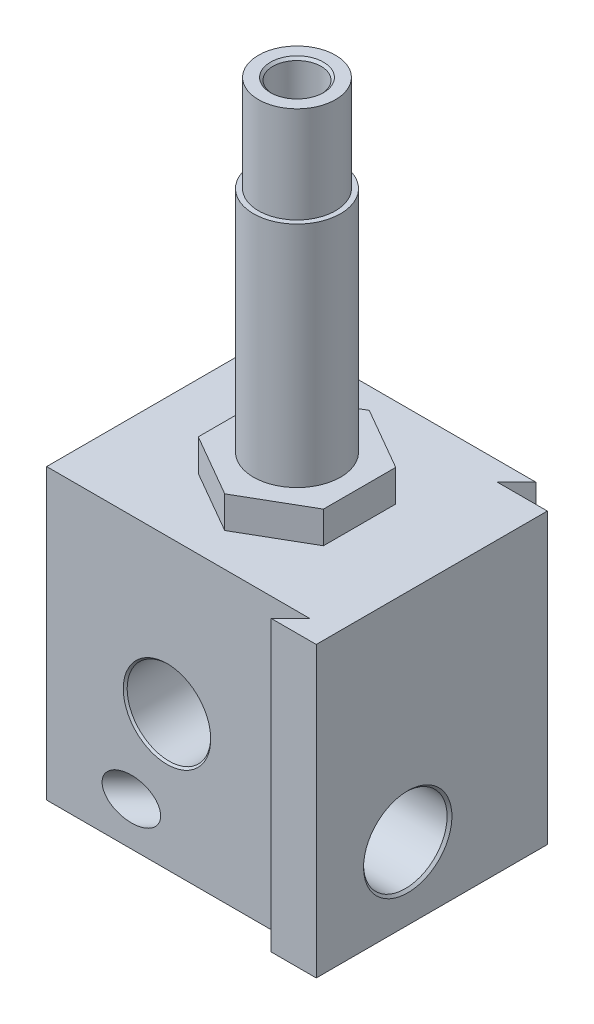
ISO-10303-21;
HEADER;
FILE_DESCRIPTION(('STEP AP214'),'2;1');
FILE_NAME('part.step','',(''),(''),'','','');
FILE_SCHEMA(('AUTOMOTIVE_DESIGN { 1 0 10303 214 1 1 1 1 }'));
ENDSEC;
DATA;
#1=APPLICATION_CONTEXT('core data for automotive mechanical design processes');
#2=APPLICATION_PROTOCOL_DEFINITION('international standard','automotive_design',2000,#1);
#3=PRODUCT_CONTEXT('',#1,'mechanical');
#4=PRODUCT('Part','Part','',(#3));
#5=PRODUCT_RELATED_PRODUCT_CATEGORY('part','',(#4));
#6=PRODUCT_DEFINITION_FORMATION('','',#4);
#7=PRODUCT_DEFINITION_CONTEXT('part definition',#1,'design');
#8=PRODUCT_DEFINITION('design','',#6,#7);
#9=PRODUCT_DEFINITION_SHAPE('','',#8);
#10=(LENGTH_UNIT() NAMED_UNIT(*) SI_UNIT(.MILLI.,.METRE.));
#11=(NAMED_UNIT(*) PLANE_ANGLE_UNIT() SI_UNIT($,.RADIAN.));
#12=(NAMED_UNIT(*) SI_UNIT($,.STERADIAN.) SOLID_ANGLE_UNIT());
#13=UNCERTAINTY_MEASURE_WITH_UNIT(LENGTH_MEASURE(1.E-05),#10,'distance_accuracy_value','');
#14=(GEOMETRIC_REPRESENTATION_CONTEXT(3) GLOBAL_UNCERTAINTY_ASSIGNED_CONTEXT((#13)) GLOBAL_UNIT_ASSIGNED_CONTEXT((#10,
#11,#12)) REPRESENTATION_CONTEXT('',''));
#15=CARTESIAN_POINT('',(0.,0.,0.));
#16=DIRECTION('',(0.,0.,1.));
#17=DIRECTION('',(1.,0.,0.));
#18=AXIS2_PLACEMENT_3D('',#15,#16,#17);
#19=CARTESIAN_POINT('',(0.,30.,-26.));
#20=DIRECTION('',(0.,-1.,0.));
#21=DIRECTION('',(-1.,0.,0.));
#22=AXIS2_PLACEMENT_3D('',#19,#20,#21);
#23=PLANE('',#22);
#24=DIRECTION('',(0.,0.,1.));
#25=VECTOR('',#24,1.);
#26=CARTESIAN_POINT('',(0.,30.,0.));
#27=LINE('',#26,#25);
#28=CARTESIAN_POINT('',(0.,30.,-26.));
#29=VERTEX_POINT('',#28);
#30=CARTESIAN_POINT('',(0.,30.,-1.99999999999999));
#31=VERTEX_POINT('',#30);
#32=EDGE_CURVE('E291',#29,#31,#27,.T.);
#33=ORIENTED_EDGE('',*,*,#32,.T.);
#34=DIRECTION('',(-1.,0.,0.));
#35=VECTOR('',#34,1.);
#36=CARTESIAN_POINT('',(0.,30.,-1.99999999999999));
#37=LINE('',#36,#35);
#38=CARTESIAN_POINT('',(27.3,30.,-1.99999999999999));
#39=VERTEX_POINT('',#38);
#40=EDGE_CURVE('E248',#39,#31,#37,.T.);
#41=ORIENTED_EDGE('',*,*,#40,.F.);
#42=DIRECTION('',(0.707106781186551,0.,-0.707106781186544));
#43=VECTOR('',#42,1.);
#44=CARTESIAN_POINT('',(27.3,30.,-1.99999999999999));
#45=LINE('',#44,#43);
#46=CARTESIAN_POINT('',(25.3,30.,0.));
#47=VERTEX_POINT('',#46);
#48=EDGE_CURVE('E245',#47,#39,#45,.T.);
#49=ORIENTED_EDGE('',*,*,#48,.F.);
#50=DIRECTION('',(1.,0.,0.));
#51=VECTOR('',#50,1.);
#52=CARTESIAN_POINT('',(0.,30.,0.));
#53=LINE('',#52,#51);
#54=CARTESIAN_POINT('',(30.,30.,0.));
#55=VERTEX_POINT('',#54);
#56=EDGE_CURVE('E294',#47,#55,#53,.T.);
#57=ORIENTED_EDGE('',*,*,#56,.T.);
#58=DIRECTION('',(0.,0.,-1.));
#59=VECTOR('',#58,1.);
#60=CARTESIAN_POINT('',(30.,30.,0.));
#61=LINE('',#60,#59);
#62=CARTESIAN_POINT('',(30.,30.,-24.));
#63=VERTEX_POINT('',#62);
#64=EDGE_CURVE('E296',#55,#63,#61,.T.);
#65=ORIENTED_EDGE('',*,*,#64,.T.);
#66=DIRECTION('',(1.,0.,0.));
#67=VECTOR('',#66,1.);
#68=CARTESIAN_POINT('',(24.8,30.,-24.));
#69=LINE('',#68,#67);
#70=CARTESIAN_POINT('',(24.8,30.,-24.));
#71=VERTEX_POINT('',#70);
#72=EDGE_CURVE('E266',#71,#63,#69,.T.);
#73=ORIENTED_EDGE('',*,*,#72,.F.);
#74=DIRECTION('',(-0.707106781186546,0.,0.707106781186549));
#75=VECTOR('',#74,1.);
#76=CARTESIAN_POINT('',(26.8,30.,-26.));
#77=LINE('',#76,#75);
#78=CARTESIAN_POINT('',(26.8,30.,-26.));
#79=VERTEX_POINT('',#78);
#80=EDGE_CURVE('E260',#79,#71,#77,.T.);
#81=ORIENTED_EDGE('',*,*,#80,.F.);
#82=DIRECTION('',(-1.,0.,0.));
#83=VECTOR('',#82,1.);
#84=CARTESIAN_POINT('',(0.,30.,-26.));
#85=LINE('',#84,#83);
#86=EDGE_CURVE('E299',#79,#29,#85,.T.);
#87=ORIENTED_EDGE('',*,*,#86,.T.);
#88=EDGE_LOOP('',(#33,#41,#49,#57,#65,#73,#81,#87));
#89=FACE_BOUND('',#88,.T.);
#90=DIRECTION('',(0.,0.,-1.));
#91=VECTOR('',#90,1.);
#92=CARTESIAN_POINT('',(8.5,30.,-9.24722325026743));
#93=LINE('',#92,#91);
#94=CARTESIAN_POINT('',(8.5,30.,-9.24722325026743));
#95=VERTEX_POINT('',#94);
#96=CARTESIAN_POINT('',(8.5,30.,-16.7527767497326));
#97=VERTEX_POINT('',#96);
#98=EDGE_CURVE('E30',#95,#97,#93,.T.);
#99=ORIENTED_EDGE('',*,*,#98,.T.);
#100=DIRECTION('',(0.866025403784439,0.,-0.5));
#101=VECTOR('',#100,1.);
#102=CARTESIAN_POINT('',(8.5,30.,-16.7527767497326));
#103=LINE('',#102,#101);
#104=CARTESIAN_POINT('',(15.,30.,-20.5055534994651));
#105=VERTEX_POINT('',#104);
#106=EDGE_CURVE('E35',#97,#105,#103,.T.);
#107=ORIENTED_EDGE('',*,*,#106,.T.);
#108=DIRECTION('',(0.866025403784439,0.,0.5));
#109=VECTOR('',#108,1.);
#110=CARTESIAN_POINT('',(15.,30.,-20.5055534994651));
#111=LINE('',#110,#109);
#112=CARTESIAN_POINT('',(21.5,30.,-16.7527767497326));
#113=VERTEX_POINT('',#112);
#114=EDGE_CURVE('E153',#105,#113,#111,.T.);
#115=ORIENTED_EDGE('',*,*,#114,.T.);
#116=DIRECTION('',(0.,0.,1.));
#117=VECTOR('',#116,1.);
#118=CARTESIAN_POINT('',(21.5,30.,-16.7527767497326));
#119=LINE('',#118,#117);
#120=CARTESIAN_POINT('',(21.5,30.,-9.24722325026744));
#121=VERTEX_POINT('',#120);
#122=EDGE_CURVE('E131',#113,#121,#119,.T.);
#123=ORIENTED_EDGE('',*,*,#122,.T.);
#124=DIRECTION('',(-0.866025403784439,0.,0.5));
#125=VECTOR('',#124,1.);
#126=CARTESIAN_POINT('',(21.5,30.,-9.24722325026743));
#127=LINE('',#126,#125);
#128=CARTESIAN_POINT('',(15.,30.,-5.49444650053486));
#129=VERTEX_POINT('',#128);
#130=EDGE_CURVE('E125',#121,#129,#127,.T.);
#131=ORIENTED_EDGE('',*,*,#130,.T.);
#132=DIRECTION('',(-0.866025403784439,0.,-0.5));
#133=VECTOR('',#132,1.);
#134=CARTESIAN_POINT('',(15.,30.,-5.49444650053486));
#135=LINE('',#134,#133);
#136=EDGE_CURVE('E128',#129,#95,#135,.T.);
#137=ORIENTED_EDGE('',*,*,#136,.T.);
#138=EDGE_LOOP('',(#99,#107,#115,#123,#131,#137));
#139=FACE_BOUND('',#138,.T.);
#140=ADVANCED_FACE('F15',(#89,#139),#23,.F.);
#141=CARTESIAN_POINT('',(12.5,14.,-26.));
#142=DIRECTION('',(0.,0.,1.));
#143=DIRECTION('',(1.,0.,0.));
#144=AXIS2_PLACEMENT_3D('',#141,#142,#143);
#145=CYLINDRICAL_SURFACE('',#144,3.);
#146=CARTESIAN_POINT('',(12.5,14.,-9.));
#147=DIRECTION('',(0.,0.,1.));
#148=DIRECTION('',(1.,0.,0.));
#149=AXIS2_PLACEMENT_3D('',#146,#147,#148);
#150=CIRCLE('',#149,3.);
#151=CARTESIAN_POINT('',(15.5,14.,-9.));
#152=VERTEX_POINT('',#151);
#153=EDGE_CURVE('E212',#152,#152,#150,.F.);
#154=ORIENTED_EDGE('',*,*,#153,.F.);
#155=EDGE_LOOP('',(#154));
#156=FACE_BOUND('',#155,.T.);
#157=CARTESIAN_POINT('',(12.5,14.,-17.6));
#158=DIRECTION('',(0.,0.,-1.));
#159=DIRECTION('',(0.,1.,0.));
#160=AXIS2_PLACEMENT_3D('',#157,#158,#159);
#161=CIRCLE('',#160,3.);
#162=CARTESIAN_POINT('',(12.5,17.,-17.6));
#163=VERTEX_POINT('',#162);
#164=EDGE_CURVE('E208',#163,#163,#161,.F.);
#165=ORIENTED_EDGE('',*,*,#164,.F.);
#166=EDGE_LOOP('',(#165));
#167=FACE_BOUND('',#166,.T.);
#168=ADVANCED_FACE('F370',(#156,#167),#145,.F.);
#169=CARTESIAN_POINT('',(0.,30.,0.));
#170=DIRECTION('',(1.,0.,0.));
#171=DIRECTION('',(0.,-1.,0.));
#172=AXIS2_PLACEMENT_3D('',#169,#170,#171);
#173=PLANE('',#172);
#174=CARTESIAN_POINT('',(0.,4.5,-17.2));
#175=DIRECTION('',(1.,0.,0.));
#176=DIRECTION('',(0.,0.,1.));
#177=AXIS2_PLACEMENT_3D('',#174,#175,#176);
#178=ELLIPSE('',#177,5.65685424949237,4.);
#179=CARTESIAN_POINT('',(0.,4.5,-11.5431457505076));
#180=VERTEX_POINT('',#179);
#181=EDGE_CURVE('E225',#180,#180,#178,.T.);
#182=ORIENTED_EDGE('',*,*,#181,.T.);
#183=EDGE_LOOP('',(#182));
#184=FACE_BOUND('',#183,.T.);
#185=DIRECTION('',(0.,0.,1.));
#186=VECTOR('',#185,1.);
#187=CARTESIAN_POINT('',(0.,0.,0.));
#188=LINE('',#187,#186);
#189=CARTESIAN_POINT('',(0.,0.,-26.));
#190=VERTEX_POINT('',#189);
#191=CARTESIAN_POINT('',(0.,0.,-2.));
#192=VERTEX_POINT('',#191);
#193=EDGE_CURVE('E278',#190,#192,#188,.T.);
#194=ORIENTED_EDGE('',*,*,#193,.T.);
#195=DIRECTION('',(0.,1.,0.));
#196=VECTOR('',#195,1.);
#197=CARTESIAN_POINT('',(0.,0.,-2.));
#198=LINE('',#197,#196);
#199=EDGE_CURVE('E257',#192,#31,#198,.T.);
#200=ORIENTED_EDGE('',*,*,#199,.T.);
#201=ORIENTED_EDGE('',*,*,#32,.F.);
#202=DIRECTION('',(0.,-1.,0.));
#203=VECTOR('',#202,1.);
#204=CARTESIAN_POINT('',(0.,30.,-26.));
#205=LINE('',#204,#203);
#206=EDGE_CURVE('E301',#29,#190,#205,.T.);
#207=ORIENTED_EDGE('',*,*,#206,.T.);
#208=EDGE_LOOP('',(#194,#200,#201,#207));
#209=FACE_BOUND('',#208,.T.);
#210=ADVANCED_FACE('F17',(#184,#209),#173,.F.);
#211=CARTESIAN_POINT('',(0.,30.,0.));
#212=DIRECTION('',(0.,0.,-1.));
#213=DIRECTION('',(0.,1.,0.));
#214=AXIS2_PLACEMENT_3D('',#211,#212,#213);
#215=PLANE('',#214);
#216=ORIENTED_EDGE('',*,*,#56,.F.);
#217=DIRECTION('',(0.,1.,0.));
#218=VECTOR('',#217,1.);
#219=CARTESIAN_POINT('',(25.3,0.,0.));
#220=LINE('',#219,#218);
#221=CARTESIAN_POINT('',(25.3,0.,0.));
#222=VERTEX_POINT('',#221);
#223=EDGE_CURVE('E256',#222,#47,#220,.T.);
#224=ORIENTED_EDGE('',*,*,#223,.F.);
#225=DIRECTION('',(1.,0.,0.));
#226=VECTOR('',#225,1.);
#227=CARTESIAN_POINT('',(0.,0.,0.));
#228=LINE('',#227,#226);
#229=CARTESIAN_POINT('',(30.,0.,0.));
#230=VERTEX_POINT('',#229);
#231=EDGE_CURVE('E284',#222,#230,#228,.T.);
#232=ORIENTED_EDGE('',*,*,#231,.T.);
#233=DIRECTION('',(0.,-1.,0.));
#234=VECTOR('',#233,1.);
#235=CARTESIAN_POINT('',(30.,30.,0.));
#236=LINE('',#235,#234);
#237=EDGE_CURVE('E304',#55,#230,#236,.T.);
#238=ORIENTED_EDGE('',*,*,#237,.F.);
#239=EDGE_LOOP('',(#216,#224,#232,#238));
#240=FACE_BOUND('',#239,.T.);
#241=ADVANCED_FACE('F389',(#240),#215,.F.);
#242=CARTESIAN_POINT('',(30.,30.,0.));
#243=DIRECTION('',(-1.,0.,0.));
#244=DIRECTION('',(0.,1.,0.));
#245=AXIS2_PLACEMENT_3D('',#242,#243,#244);
#246=PLANE('',#245);
#247=CARTESIAN_POINT('',(30.,7.5,-9.5));
#248=DIRECTION('',(-1.,0.,0.));
#249=DIRECTION('',(0.,1.,0.));
#250=AXIS2_PLACEMENT_3D('',#247,#248,#249);
#251=CIRCLE('',#250,4.59);
#252=CARTESIAN_POINT('',(30.,12.09,-9.5));
#253=VERTEX_POINT('',#252);
#254=EDGE_CURVE('E314',#253,#253,#251,.T.);
#255=ORIENTED_EDGE('',*,*,#254,.T.);
#256=EDGE_LOOP('',(#255));
#257=FACE_BOUND('',#256,.T.);
#258=DIRECTION('',(0.,0.,-1.));
#259=VECTOR('',#258,1.);
#260=CARTESIAN_POINT('',(30.,0.,0.));
#261=LINE('',#260,#259);
#262=CARTESIAN_POINT('',(30.,0.,-24.));
#263=VERTEX_POINT('',#262);
#264=EDGE_CURVE('E286',#230,#263,#261,.T.);
#265=ORIENTED_EDGE('',*,*,#264,.T.);
#266=DIRECTION('',(0.,1.,0.));
#267=VECTOR('',#266,1.);
#268=CARTESIAN_POINT('',(30.,0.,-24.));
#269=LINE('',#268,#267);
#270=EDGE_CURVE('E275',#263,#63,#269,.T.);
#271=ORIENTED_EDGE('',*,*,#270,.T.);
#272=ORIENTED_EDGE('',*,*,#64,.F.);
#273=ORIENTED_EDGE('',*,*,#237,.T.);
#274=EDGE_LOOP('',(#265,#271,#272,#273));
#275=FACE_BOUND('',#274,.T.);
#276=ADVANCED_FACE('F386',(#257,#275),#246,.F.);
#277=CARTESIAN_POINT('',(0.,30.,-26.));
#278=DIRECTION('',(0.,0.,1.));
#279=DIRECTION('',(0.,-1.,0.));
#280=AXIS2_PLACEMENT_3D('',#277,#278,#279);
#281=PLANE('',#280);
#282=CARTESIAN_POINT('',(8.80000000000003,4.5,-26.));
#283=DIRECTION('',(0.,0.,1.));
#284=DIRECTION('',(-1.,0.,0.));
#285=AXIS2_PLACEMENT_3D('',#282,#283,#284);
#286=ELLIPSE('',#285,3.04055915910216,2.15);
#287=CARTESIAN_POINT('',(5.75944084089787,4.5,-26.));
#288=VERTEX_POINT('',#287);
#289=EDGE_CURVE('E219',#288,#288,#286,.T.);
#290=ORIENTED_EDGE('',*,*,#289,.T.);
#291=EDGE_LOOP('',(#290));
#292=FACE_BOUND('',#291,.T.);
#293=CARTESIAN_POINT('',(12.5,14.,-26.));
#294=DIRECTION('',(0.,0.,-1.));
#295=DIRECTION('',(0.,1.,0.));
#296=AXIS2_PLACEMENT_3D('',#293,#294,#295);
#297=CIRCLE('',#296,7.);
#298=CARTESIAN_POINT('',(12.5,21.,-26.));
#299=VERTEX_POINT('',#298);
#300=EDGE_CURVE('E239',#299,#299,#297,.T.);
#301=ORIENTED_EDGE('',*,*,#300,.F.);
#302=EDGE_LOOP('',(#301));
#303=FACE_BOUND('',#302,.T.);
#304=ORIENTED_EDGE('',*,*,#86,.F.);
#305=DIRECTION('',(0.,1.,0.));
#306=VECTOR('',#305,1.);
#307=CARTESIAN_POINT('',(26.8,0.,-26.));
#308=LINE('',#307,#306);
#309=CARTESIAN_POINT('',(26.8,0.,-26.));
#310=VERTEX_POINT('',#309);
#311=EDGE_CURVE('E274',#310,#79,#308,.T.);
#312=ORIENTED_EDGE('',*,*,#311,.F.);
#313=DIRECTION('',(-1.,0.,0.));
#314=VECTOR('',#313,1.);
#315=CARTESIAN_POINT('',(0.,0.,-26.));
#316=LINE('',#315,#314);
#317=EDGE_CURVE('E289',#310,#190,#316,.T.);
#318=ORIENTED_EDGE('',*,*,#317,.T.);
#319=ORIENTED_EDGE('',*,*,#206,.F.);
#320=EDGE_LOOP('',(#304,#312,#318,#319));
#321=FACE_BOUND('',#320,.T.);
#322=ADVANCED_FACE('F383',(#292,#303,#321),#281,.F.);
#323=CARTESIAN_POINT('',(0.,0.,-26.));
#324=DIRECTION('',(0.,-1.,0.));
#325=DIRECTION('',(-1.,0.,0.));
#326=AXIS2_PLACEMENT_3D('',#323,#324,#325);
#327=PLANE('',#326);
#328=CARTESIAN_POINT('',(3.,0.,-5.));
#329=DIRECTION('',(0.,-1.,0.));
#330=DIRECTION('',(-1.,0.,0.));
#331=AXIS2_PLACEMENT_3D('',#328,#329,#330);
#332=CIRCLE('',#331,1.84999999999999);
#333=CARTESIAN_POINT('',(1.15000000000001,0.,-5.));
#334=VERTEX_POINT('',#333);
#335=EDGE_CURVE('E329',#334,#334,#332,.F.);
#336=ORIENTED_EDGE('',*,*,#335,.T.);
#337=EDGE_LOOP('',(#336));
#338=FACE_BOUND('',#337,.T.);
#339=CARTESIAN_POINT('',(22.5,0.,-21.5));
#340=DIRECTION('',(0.,-1.,0.));
#341=DIRECTION('',(-1.,0.,0.));
#342=AXIS2_PLACEMENT_3D('',#339,#340,#341);
#343=CIRCLE('',#342,1.84999999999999);
#344=CARTESIAN_POINT('',(20.65,0.,-21.5));
#345=VERTEX_POINT('',#344);
#346=EDGE_CURVE('E326',#345,#345,#343,.F.);
#347=ORIENTED_EDGE('',*,*,#346,.T.);
#348=EDGE_LOOP('',(#347));
#349=FACE_BOUND('',#348,.T.);
#350=DIRECTION('',(-1.,0.,0.));
#351=VECTOR('',#350,1.);
#352=CARTESIAN_POINT('',(0.,0.,-2.));
#353=LINE('',#352,#351);
#354=CARTESIAN_POINT('',(27.3,0.,-2.));
#355=VERTEX_POINT('',#354);
#356=EDGE_CURVE('E253',#355,#192,#353,.T.);
#357=ORIENTED_EDGE('',*,*,#356,.T.);
#358=ORIENTED_EDGE('',*,*,#193,.F.);
#359=ORIENTED_EDGE('',*,*,#317,.F.);
#360=DIRECTION('',(-0.707106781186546,0.,0.707106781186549));
#361=VECTOR('',#360,1.);
#362=CARTESIAN_POINT('',(26.8,0.,-26.));
#363=LINE('',#362,#361);
#364=CARTESIAN_POINT('',(24.8,0.,-24.));
#365=VERTEX_POINT('',#364);
#366=EDGE_CURVE('E268',#310,#365,#363,.T.);
#367=ORIENTED_EDGE('',*,*,#366,.T.);
#368=DIRECTION('',(1.,0.,0.));
#369=VECTOR('',#368,1.);
#370=CARTESIAN_POINT('',(24.8,0.,-24.));
#371=LINE('',#370,#369);
#372=EDGE_CURVE('E271',#365,#263,#371,.T.);
#373=ORIENTED_EDGE('',*,*,#372,.T.);
#374=ORIENTED_EDGE('',*,*,#264,.F.);
#375=ORIENTED_EDGE('',*,*,#231,.F.);
#376=DIRECTION('',(0.707106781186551,0.,-0.707106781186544));
#377=VECTOR('',#376,1.);
#378=CARTESIAN_POINT('',(27.3,0.,-2.));
#379=LINE('',#378,#377);
#380=EDGE_CURVE('E250',#222,#355,#379,.T.);
#381=ORIENTED_EDGE('',*,*,#380,.T.);
#382=EDGE_LOOP('',(#357,#358,#359,#367,#373,#374,#375,#381));
#383=FACE_BOUND('',#382,.T.);
#384=ADVANCED_FACE('F381',(#338,#349,#383),#327,.T.);
#385=CARTESIAN_POINT('',(24.8,0.,-24.));
#386=DIRECTION('',(0.,0.,1.));
#387=DIRECTION('',(0.,-1.,0.));
#388=AXIS2_PLACEMENT_3D('',#385,#386,#387);
#389=PLANE('',#388);
#390=ORIENTED_EDGE('',*,*,#72,.T.);
#391=ORIENTED_EDGE('',*,*,#270,.F.);
#392=ORIENTED_EDGE('',*,*,#372,.F.);
#393=DIRECTION('',(0.,1.,0.));
#394=VECTOR('',#393,1.);
#395=CARTESIAN_POINT('',(24.8,0.,-24.));
#396=LINE('',#395,#394);
#397=EDGE_CURVE('E279',#365,#71,#396,.T.);
#398=ORIENTED_EDGE('',*,*,#397,.T.);
#399=EDGE_LOOP('',(#390,#391,#392,#398));
#400=FACE_BOUND('',#399,.T.);
#401=ADVANCED_FACE('F414',(#400),#389,.F.);
#402=CARTESIAN_POINT('',(26.8,0.,-26.));
#403=DIRECTION('',(-0.707106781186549,0.,-0.707106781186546));
#404=DIRECTION('',(-0.707106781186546,0.,0.707106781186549));
#405=AXIS2_PLACEMENT_3D('',#402,#403,#404);
#406=PLANE('',#405);
#407=ORIENTED_EDGE('',*,*,#80,.T.);
#408=ORIENTED_EDGE('',*,*,#397,.F.);
#409=ORIENTED_EDGE('',*,*,#366,.F.);
#410=ORIENTED_EDGE('',*,*,#311,.T.);
#411=EDGE_LOOP('',(#407,#408,#409,#410));
#412=FACE_BOUND('',#411,.T.);
#413=ADVANCED_FACE('F419',(#412),#406,.F.);
#414=CARTESIAN_POINT('',(0.,0.,-2.));
#415=DIRECTION('',(0.,0.,-1.));
#416=DIRECTION('',(-1.,0.,0.));
#417=AXIS2_PLACEMENT_3D('',#414,#415,#416);
#418=PLANE('',#417);
#419=CARTESIAN_POINT('',(12.5,14.,-2.));
#420=DIRECTION('',(0.,0.,-1.));
#421=DIRECTION('',(-1.,0.,0.));
#422=AXIS2_PLACEMENT_3D('',#419,#420,#421);
#423=CIRCLE('',#422,4.54000000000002);
#424=CARTESIAN_POINT('',(7.95999999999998,14.,-2.));
#425=VERTEX_POINT('',#424);
#426=EDGE_CURVE('E10',#425,#425,#423,.T.);
#427=ORIENTED_EDGE('',*,*,#426,.T.);
#428=EDGE_LOOP('',(#427));
#429=FACE_BOUND('',#428,.T.);
#430=CARTESIAN_POINT('',(8.8,4.5,-2.));
#431=DIRECTION('',(0.,0.,-1.));
#432=DIRECTION('',(-1.,0.,0.));
#433=AXIS2_PLACEMENT_3D('',#430,#431,#432);
#434=ELLIPSE('',#433,3.04055915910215,2.15);
#435=CARTESIAN_POINT('',(5.75944084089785,4.5,-2.));
#436=VERTEX_POINT('',#435);
#437=EDGE_CURVE('E232',#436,#436,#434,.T.);
#438=ORIENTED_EDGE('',*,*,#437,.T.);
#439=EDGE_LOOP('',(#438));
#440=FACE_BOUND('',#439,.T.);
#441=ORIENTED_EDGE('',*,*,#40,.T.);
#442=ORIENTED_EDGE('',*,*,#199,.F.);
#443=ORIENTED_EDGE('',*,*,#356,.F.);
#444=DIRECTION('',(0.,1.,0.));
#445=VECTOR('',#444,1.);
#446=CARTESIAN_POINT('',(27.3,0.,-2.));
#447=LINE('',#446,#445);
#448=EDGE_CURVE('E261',#355,#39,#447,.T.);
#449=ORIENTED_EDGE('',*,*,#448,.T.);
#450=EDGE_LOOP('',(#441,#442,#443,#449));
#451=FACE_BOUND('',#450,.T.);
#452=ADVANCED_FACE('F427',(#429,#440,#451),#418,.F.);
#453=CARTESIAN_POINT('',(27.3,0.,-2.));
#454=DIRECTION('',(0.707106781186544,0.,0.707106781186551));
#455=DIRECTION('',(0.707106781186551,0.,-0.707106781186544));
#456=AXIS2_PLACEMENT_3D('',#453,#454,#455);
#457=PLANE('',#456);
#458=ORIENTED_EDGE('',*,*,#48,.T.);
#459=ORIENTED_EDGE('',*,*,#448,.F.);
#460=ORIENTED_EDGE('',*,*,#380,.F.);
#461=ORIENTED_EDGE('',*,*,#223,.T.);
#462=EDGE_LOOP('',(#458,#459,#460,#461));
#463=FACE_BOUND('',#462,.T.);
#464=ADVANCED_FACE('F408',(#463),#457,.F.);
#465=CARTESIAN_POINT('',(12.5,14.,-24.6));
#466=DIRECTION('',(0.,0.,-1.));
#467=DIRECTION('',(0.,1.,0.));
#468=AXIS2_PLACEMENT_3D('',#465,#466,#467);
#469=PLANE('',#468);
#470=CARTESIAN_POINT('',(12.5,14.,-24.6));
#471=DIRECTION('',(0.,0.,-1.));
#472=DIRECTION('',(0.,1.,0.));
#473=AXIS2_PLACEMENT_3D('',#470,#471,#472);
#474=CIRCLE('',#473,4.54);
#475=CARTESIAN_POINT('',(12.5,18.54,-24.6));
#476=VERTEX_POINT('',#475);
#477=EDGE_CURVE('E342',#476,#476,#474,.F.);
#478=ORIENTED_EDGE('',*,*,#477,.T.);
#479=EDGE_LOOP('',(#478));
#480=FACE_BOUND('',#479,.T.);
#481=CARTESIAN_POINT('',(12.5,14.,-24.6));
#482=DIRECTION('',(0.,0.,-1.));
#483=DIRECTION('',(0.,1.,0.));
#484=AXIS2_PLACEMENT_3D('',#481,#482,#483);
#485=CIRCLE('',#484,7.);
#486=CARTESIAN_POINT('',(12.5,21.,-24.6));
#487=VERTEX_POINT('',#486);
#488=EDGE_CURVE('E242',#487,#487,#485,.T.);
#489=ORIENTED_EDGE('',*,*,#488,.T.);
#490=EDGE_LOOP('',(#489));
#491=FACE_BOUND('',#490,.T.);
#492=ADVANCED_FACE('F436',(#480,#491),#469,.T.);
#493=CARTESIAN_POINT('',(12.5,14.,-24.6));
#494=DIRECTION('',(0.,0.,-1.));
#495=DIRECTION('',(0.,1.,0.));
#496=AXIS2_PLACEMENT_3D('',#493,#494,#495);
#497=CYLINDRICAL_SURFACE('',#496,7.);
#498=ORIENTED_EDGE('',*,*,#488,.F.);
#499=EDGE_LOOP('',(#498));
#500=FACE_BOUND('',#499,.T.);
#501=ORIENTED_EDGE('',*,*,#300,.T.);
#502=EDGE_LOOP('',(#501));
#503=FACE_BOUND('',#502,.T.);
#504=ADVANCED_FACE('F489',(#500,#503),#497,.F.);
#505=CARTESIAN_POINT('',(3.,0.,-5.));
#506=DIRECTION('',(0.,-1.,0.));
#507=DIRECTION('',(-1.,0.,0.));
#508=AXIS2_PLACEMENT_3D('',#505,#506,#507);
#509=CYLINDRICAL_SURFACE('',#508,1.64999999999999);
#510=CARTESIAN_POINT('',(3.,0.199999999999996,-5.));
#511=DIRECTION('',(0.,-1.,0.));
#512=DIRECTION('',(-1.,0.,0.));
#513=AXIS2_PLACEMENT_3D('',#510,#511,#512);
#514=CIRCLE('',#513,1.64999999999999);
#515=CARTESIAN_POINT('',(1.35000000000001,0.199999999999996,-5.));
#516=VERTEX_POINT('',#515);
#517=EDGE_CURVE('E323',#516,#516,#514,.T.);
#518=ORIENTED_EDGE('',*,*,#517,.T.);
#519=EDGE_LOOP('',(#518));
#520=FACE_BOUND('',#519,.T.);
#521=CARTESIAN_POINT('',(3.,12.,-5.));
#522=DIRECTION('',(0.,-1.,0.));
#523=DIRECTION('',(-1.,0.,0.));
#524=AXIS2_PLACEMENT_3D('',#521,#522,#523);
#525=CIRCLE('',#524,1.65);
#526=CARTESIAN_POINT('',(1.35,12.,-5.));
#527=VERTEX_POINT('',#526);
#528=EDGE_CURVE('E236',#527,#527,#525,.T.);
#529=ORIENTED_EDGE('',*,*,#528,.F.);
#530=EDGE_LOOP('',(#529));
#531=FACE_BOUND('',#530,.T.);
#532=ADVANCED_FACE('F485',(#520,#531),#509,.F.);
#533=CARTESIAN_POINT('',(3.,12.,-5.));
#534=DIRECTION('',(0.,-1.,0.));
#535=DIRECTION('',(-1.,0.,0.));
#536=AXIS2_PLACEMENT_3D('',#533,#534,#535);
#537=CONICAL_SURFACE('',#536,1.65,1.0471975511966);
#538=CARTESIAN_POINT('',(3.,12.9526279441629,-5.));
#539=VERTEX_POINT('',#538);
#540=VERTEX_LOOP('',#539);
#541=FACE_BOUND('',#540,.T.);
#542=ORIENTED_EDGE('',*,*,#528,.T.);
#543=EDGE_LOOP('',(#542));
#544=FACE_BOUND('',#543,.T.);
#545=ADVANCED_FACE('F466',(#541,#544),#537,.F.);
#546=CARTESIAN_POINT('',(22.5,0.,-21.5));
#547=DIRECTION('',(0.,-1.,0.));
#548=DIRECTION('',(-1.,0.,0.));
#549=AXIS2_PLACEMENT_3D('',#546,#547,#548);
#550=CYLINDRICAL_SURFACE('',#549,1.65);
#551=CARTESIAN_POINT('',(22.5,0.199999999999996,-21.5));
#552=DIRECTION('',(0.,-1.,0.));
#553=DIRECTION('',(-1.,0.,0.));
#554=AXIS2_PLACEMENT_3D('',#551,#552,#553);
#555=CIRCLE('',#554,1.65);
#556=CARTESIAN_POINT('',(20.85,0.199999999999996,-21.5));
#557=VERTEX_POINT('',#556);
#558=EDGE_CURVE('E332',#557,#557,#555,.T.);
#559=ORIENTED_EDGE('',*,*,#558,.T.);
#560=EDGE_LOOP('',(#559));
#561=FACE_BOUND('',#560,.T.);
#562=CARTESIAN_POINT('',(22.5,12.,-21.5));
#563=DIRECTION('',(0.,-1.,0.));
#564=DIRECTION('',(-1.,0.,0.));
#565=AXIS2_PLACEMENT_3D('',#562,#563,#564);
#566=CIRCLE('',#565,1.65);
#567=CARTESIAN_POINT('',(20.85,12.,-21.5));
#568=VERTEX_POINT('',#567);
#569=EDGE_CURVE('E233',#568,#568,#566,.T.);
#570=ORIENTED_EDGE('',*,*,#569,.F.);
#571=EDGE_LOOP('',(#570));
#572=FACE_BOUND('',#571,.T.);
#573=ADVANCED_FACE('F462',(#561,#572),#550,.F.);
#574=CARTESIAN_POINT('',(22.5,12.,-21.5));
#575=DIRECTION('',(0.,-1.,0.));
#576=DIRECTION('',(-1.,0.,0.));
#577=AXIS2_PLACEMENT_3D('',#574,#575,#576);
#578=CONICAL_SURFACE('',#577,1.65,1.0471975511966);
#579=CARTESIAN_POINT('',(22.5,12.9526279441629,-21.5));
#580=VERTEX_POINT('',#579);
#581=VERTEX_LOOP('',#580);
#582=FACE_BOUND('',#581,.T.);
#583=ORIENTED_EDGE('',*,*,#569,.T.);
#584=EDGE_LOOP('',(#583));
#585=FACE_BOUND('',#584,.T.);
#586=ADVANCED_FACE('F465',(#582,#585),#578,.F.);
#587=CARTESIAN_POINT('',(10.5664263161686,4.5,-3.76642631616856));
#588=DIRECTION('',(-0.707106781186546,0.,0.707106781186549));
#589=DIRECTION('',(0.707106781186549,0.,0.707106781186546));
#590=AXIS2_PLACEMENT_3D('',#587,#588,#589);
#591=CYLINDRICAL_SURFACE('',#590,2.15);
#592=CARTESIAN_POINT('',(10.5664263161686,4.5,-3.76642631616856));
#593=DIRECTION('',(-0.707106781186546,0.,0.707106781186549));
#594=DIRECTION('',(0.707106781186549,0.,0.707106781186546));
#595=AXIS2_PLACEMENT_3D('',#592,#593,#594);
#596=CIRCLE('',#595,2.15);
#597=CARTESIAN_POINT('',(12.0867058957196,4.5,-2.24614673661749));
#598=VERTEX_POINT('',#597);
#599=EDGE_CURVE('E229',#598,#598,#596,.T.);
#600=ORIENTED_EDGE('',*,*,#599,.F.);
#601=EDGE_LOOP('',(#600));
#602=FACE_BOUND('',#601,.T.);
#603=ORIENTED_EDGE('',*,*,#437,.F.);
#604=EDGE_LOOP('',(#603));
#605=FACE_BOUND('',#604,.T.);
#606=ADVANCED_FACE('F471',(#602,#605),#591,.F.);
#607=CARTESIAN_POINT('',(10.5664263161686,4.5,-3.76642631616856));
#608=DIRECTION('',(-0.707106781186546,0.,0.707106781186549));
#609=DIRECTION('',(0.707106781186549,0.,0.707106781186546));
#610=AXIS2_PLACEMENT_3D('',#607,#608,#609);
#611=PLANE('',#610);
#612=CARTESIAN_POINT('',(10.5664263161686,4.5,-3.76642631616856));
#613=DIRECTION('',(-0.707106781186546,0.,0.707106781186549));
#614=DIRECTION('',(0.707106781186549,0.,0.707106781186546));
#615=AXIS2_PLACEMENT_3D('',#612,#613,#614);
#616=CIRCLE('',#615,1.84999999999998);
#617=CARTESIAN_POINT('',(11.8745738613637,4.5,-2.45827877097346));
#618=VERTEX_POINT('',#617);
#619=EDGE_CURVE('E320',#618,#618,#616,.F.);
#620=ORIENTED_EDGE('',*,*,#619,.T.);
#621=EDGE_LOOP('',(#620));
#622=FACE_BOUND('',#621,.T.);
#623=ORIENTED_EDGE('',*,*,#599,.T.);
#624=EDGE_LOOP('',(#623));
#625=FACE_BOUND('',#624,.T.);
#626=ADVANCED_FACE('F478',(#622,#625),#611,.T.);
#627=CARTESIAN_POINT('',(10.5664263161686,4.5,-3.76642631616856));
#628=DIRECTION('',(-0.707106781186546,0.,0.707106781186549));
#629=DIRECTION('',(0.707106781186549,0.,0.707106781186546));
#630=AXIS2_PLACEMENT_3D('',#627,#628,#629);
#631=CYLINDRICAL_SURFACE('',#630,1.64999999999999);
#632=CARTESIAN_POINT('',(10.7078476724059,4.5,-3.90784767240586));
#633=DIRECTION('',(-0.707106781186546,0.,0.707106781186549));
#634=DIRECTION('',(0.707106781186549,0.,0.707106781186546));
#635=AXIS2_PLACEMENT_3D('',#632,#633,#634);
#636=CIRCLE('',#635,1.64999999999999);
#637=CARTESIAN_POINT('',(11.8745738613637,4.5,-2.74112148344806));
#638=VERTEX_POINT('',#637);
#639=EDGE_CURVE('E317',#638,#638,#636,.T.);
#640=ORIENTED_EDGE('',*,*,#639,.T.);
#641=EDGE_LOOP('',(#640));
#642=FACE_BOUND('',#641,.T.);
#643=CARTESIAN_POINT('',(15.8697271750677,4.5,-9.06972717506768));
#644=DIRECTION('',(-0.707106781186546,0.,0.707106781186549));
#645=DIRECTION('',(0.707106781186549,0.,0.707106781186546));
#646=AXIS2_PLACEMENT_3D('',#643,#644,#645);
#647=CIRCLE('',#646,1.65);
#648=CARTESIAN_POINT('',(17.0364533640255,4.5,-7.90300098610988));
#649=VERTEX_POINT('',#648);
#650=EDGE_CURVE('E226',#649,#649,#647,.T.);
#651=ORIENTED_EDGE('',*,*,#650,.F.);
#652=EDGE_LOOP('',(#651));
#653=FACE_BOUND('',#652,.T.);
#654=ADVANCED_FACE('F536',(#642,#653),#631,.F.);
#655=CARTESIAN_POINT('',(15.8697271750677,4.5,-9.06972717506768));
#656=DIRECTION('',(-0.707106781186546,0.,0.707106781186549));
#657=DIRECTION('',(0.707106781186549,0.,0.707106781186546));
#658=AXIS2_PLACEMENT_3D('',#655,#656,#657);
#659=CONICAL_SURFACE('',#658,1.65,1.0471975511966);
#660=CARTESIAN_POINT('',(16.543336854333,4.5,-9.74333685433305));
#661=VERTEX_POINT('',#660);
#662=VERTEX_LOOP('',#661);
#663=FACE_BOUND('',#662,.T.);
#664=ORIENTED_EDGE('',*,*,#650,.T.);
#665=EDGE_LOOP('',(#664));
#666=FACE_BOUND('',#665,.T.);
#667=ADVANCED_FACE('F543',(#663,#666),#659,.F.);
#668=CARTESIAN_POINT('',(5.58614357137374,4.5,-22.7861435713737));
#669=DIRECTION('',(-0.707106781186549,0.,0.707106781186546));
#670=DIRECTION('',(0.707106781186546,0.,0.707106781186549));
#671=AXIS2_PLACEMENT_3D('',#668,#669,#670);
#672=CYLINDRICAL_SURFACE('',#671,4.);
#673=CARTESIAN_POINT('',(5.58614357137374,4.5,-22.7861435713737));
#674=DIRECTION('',(-0.707106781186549,0.,0.707106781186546));
#675=DIRECTION('',(0.707106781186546,0.,0.707106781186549));
#676=AXIS2_PLACEMENT_3D('',#673,#674,#675);
#677=CIRCLE('',#676,4.);
#678=CARTESIAN_POINT('',(8.41457069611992,4.5,-19.9577164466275));
#679=VERTEX_POINT('',#678);
#680=EDGE_CURVE('E222',#679,#679,#677,.T.);
#681=ORIENTED_EDGE('',*,*,#680,.F.);
#682=EDGE_LOOP('',(#681));
#683=FACE_BOUND('',#682,.T.);
#684=ORIENTED_EDGE('',*,*,#181,.F.);
#685=EDGE_LOOP('',(#684));
#686=FACE_BOUND('',#685,.T.);
#687=ADVANCED_FACE('F552',(#683,#686),#672,.F.);
#688=CARTESIAN_POINT('',(5.58614357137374,4.5,-22.7861435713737));
#689=DIRECTION('',(-0.707106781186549,0.,0.707106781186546));
#690=DIRECTION('',(0.707106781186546,0.,0.707106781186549));
#691=AXIS2_PLACEMENT_3D('',#688,#689,#690);
#692=PLANE('',#691);
#693=CARTESIAN_POINT('',(5.58614357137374,4.5,-22.7861435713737));
#694=DIRECTION('',(-0.707106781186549,0.,0.707106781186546));
#695=DIRECTION('',(0.707106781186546,0.,0.707106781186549));
#696=AXIS2_PLACEMENT_3D('',#693,#694,#695);
#697=CIRCLE('',#696,2.15);
#698=CARTESIAN_POINT('',(7.10642315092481,4.5,-21.2658639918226));
#699=VERTEX_POINT('',#698);
#700=EDGE_CURVE('E216',#699,#699,#697,.T.);
#701=ORIENTED_EDGE('',*,*,#700,.F.);
#702=EDGE_LOOP('',(#701));
#703=FACE_BOUND('',#702,.T.);
#704=ORIENTED_EDGE('',*,*,#680,.T.);
#705=EDGE_LOOP('',(#704));
#706=FACE_BOUND('',#705,.T.);
#707=ADVANCED_FACE('F560',(#703,#706),#692,.T.);
#708=CARTESIAN_POINT('',(19.4000000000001,4.5,-36.6));
#709=DIRECTION('',(-0.707106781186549,0.,0.707106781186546));
#710=DIRECTION('',(0.707106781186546,0.,0.707106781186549));
#711=AXIS2_PLACEMENT_3D('',#708,#709,#710);
#712=CYLINDRICAL_SURFACE('',#711,2.15);
#713=ORIENTED_EDGE('',*,*,#700,.T.);
#714=EDGE_LOOP('',(#713));
#715=FACE_BOUND('',#714,.T.);
#716=ORIENTED_EDGE('',*,*,#289,.F.);
#717=EDGE_LOOP('',(#716));
#718=FACE_BOUND('',#717,.T.);
#719=ADVANCED_FACE('F568',(#715,#718),#712,.F.);
#720=CARTESIAN_POINT('',(18.7,7.5,-9.5));
#721=DIRECTION('',(1.,0.,0.));
#722=DIRECTION('',(0.,-1.,0.));
#723=AXIS2_PLACEMENT_3D('',#720,#721,#722);
#724=CYLINDRICAL_SURFACE('',#723,4.34);
#725=CARTESIAN_POINT('',(29.75,7.5,-9.5));
#726=DIRECTION('',(-1.,0.,0.));
#727=DIRECTION('',(0.,1.,0.));
#728=AXIS2_PLACEMENT_3D('',#725,#726,#727);
#729=CIRCLE('',#728,4.34);
#730=CARTESIAN_POINT('',(29.75,11.84,-9.5));
#731=VERTEX_POINT('',#730);
#732=EDGE_CURVE('E307',#731,#731,#729,.F.);
#733=ORIENTED_EDGE('',*,*,#732,.T.);
#734=EDGE_LOOP('',(#733));
#735=FACE_BOUND('',#734,.T.);
#736=CARTESIAN_POINT('',(18.7,7.5,-9.5));
#737=DIRECTION('',(1.,0.,0.));
#738=DIRECTION('',(0.,-1.,0.));
#739=AXIS2_PLACEMENT_3D('',#736,#737,#738);
#740=CIRCLE('',#739,4.34);
#741=CARTESIAN_POINT('',(18.7,3.16,-9.5));
#742=VERTEX_POINT('',#741);
#743=EDGE_CURVE('E213',#742,#742,#740,.T.);
#744=ORIENTED_EDGE('',*,*,#743,.F.);
#745=EDGE_LOOP('',(#744));
#746=FACE_BOUND('',#745,.T.);
#747=ADVANCED_FACE('F576',(#735,#746),#724,.F.);
#748=CARTESIAN_POINT('',(18.7,7.5,-9.5));
#749=DIRECTION('',(1.,0.,0.));
#750=DIRECTION('',(0.,-1.,0.));
#751=AXIS2_PLACEMENT_3D('',#748,#749,#750);
#752=PLANE('',#751);
#753=ORIENTED_EDGE('',*,*,#743,.T.);
#754=EDGE_LOOP('',(#753));
#755=FACE_BOUND('',#754,.T.);
#756=ADVANCED_FACE('F584',(#755),#752,.T.);
#757=CARTESIAN_POINT('',(29.75,7.5,-9.5));
#758=DIRECTION('',(1.,0.,0.));
#759=DIRECTION('',(0.,-1.,0.));
#760=AXIS2_PLACEMENT_3D('',#757,#758,#759);
#761=CONICAL_SURFACE('',#760,4.34,0.785398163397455);
#762=ORIENTED_EDGE('',*,*,#254,.F.);
#763=EDGE_LOOP('',(#762));
#764=FACE_BOUND('',#763,.T.);
#765=ORIENTED_EDGE('',*,*,#732,.F.);
#766=EDGE_LOOP('',(#765));
#767=FACE_BOUND('',#766,.T.);
#768=ADVANCED_FACE('F592',(#764,#767),#761,.F.);
#769=CARTESIAN_POINT('',(10.7078476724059,4.5,-3.90784767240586));
#770=DIRECTION('',(-0.707106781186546,0.,0.707106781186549));
#771=DIRECTION('',(0.707106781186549,0.,0.707106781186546));
#772=AXIS2_PLACEMENT_3D('',#769,#770,#771);
#773=CONICAL_SURFACE('',#772,1.64999999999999,0.785398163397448);
#774=ORIENTED_EDGE('',*,*,#619,.F.);
#775=EDGE_LOOP('',(#774));
#776=FACE_BOUND('',#775,.T.);
#777=ORIENTED_EDGE('',*,*,#639,.F.);
#778=EDGE_LOOP('',(#777));
#779=FACE_BOUND('',#778,.T.);
#780=ADVANCED_FACE('F600',(#776,#779),#773,.F.);
#781=CARTESIAN_POINT('',(3.,0.199999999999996,-5.));
#782=DIRECTION('',(0.,-1.,0.));
#783=DIRECTION('',(-1.,0.,0.));
#784=AXIS2_PLACEMENT_3D('',#781,#782,#783);
#785=CONICAL_SURFACE('',#784,1.64999999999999,0.785398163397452);
#786=ORIENTED_EDGE('',*,*,#335,.F.);
#787=EDGE_LOOP('',(#786));
#788=FACE_BOUND('',#787,.T.);
#789=ORIENTED_EDGE('',*,*,#517,.F.);
#790=EDGE_LOOP('',(#789));
#791=FACE_BOUND('',#790,.T.);
#792=ADVANCED_FACE('F458',(#788,#791),#785,.F.);
#793=CARTESIAN_POINT('',(22.5,0.199999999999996,-21.5));
#794=DIRECTION('',(0.,-1.,0.));
#795=DIRECTION('',(-1.,0.,0.));
#796=AXIS2_PLACEMENT_3D('',#793,#794,#795);
#797=CONICAL_SURFACE('',#796,1.65,0.785398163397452);
#798=CARTESIAN_POINT('',(20.65,0.,-21.5));
#799=CARTESIAN_POINT('',(20.6520833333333,0.00208333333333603,-21.5));
#800=CARTESIAN_POINT('',(20.6541666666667,0.00416666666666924,-21.5));
#801=CARTESIAN_POINT('',(20.6583333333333,0.00833333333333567,-21.5));
#802=CARTESIAN_POINT('',(20.6604166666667,0.0104166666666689,-21.5));
#803=CARTESIAN_POINT('',(20.6645833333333,0.0145833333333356,-21.5));
#804=CARTESIAN_POINT('',(20.6666666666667,0.0166666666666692,-21.5));
#805=CARTESIAN_POINT('',(20.6708333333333,0.0208333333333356,-21.5));
#806=CARTESIAN_POINT('',(20.6729166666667,0.0229166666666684,-21.5));
#807=CARTESIAN_POINT('',(20.6770833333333,0.0270833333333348,-21.5));
#808=CARTESIAN_POINT('',(20.6791666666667,0.0291666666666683,-21.5));
#809=CARTESIAN_POINT('',(20.6833333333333,0.033333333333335,-21.5));
#810=CARTESIAN_POINT('',(20.6854166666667,0.0354166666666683,-21.5));
#811=CARTESIAN_POINT('',(20.6895833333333,0.0395833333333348,-21.5));
#812=CARTESIAN_POINT('',(20.6916666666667,0.0416666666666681,-21.5));
#813=CARTESIAN_POINT('',(20.6958333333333,0.0458333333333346,-21.5));
#814=CARTESIAN_POINT('',(20.6979166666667,0.0479166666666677,-21.5));
#815=CARTESIAN_POINT('',(20.7020833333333,0.0520833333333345,-21.5));
#816=CARTESIAN_POINT('',(20.7041666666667,0.054166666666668,-21.5));
#817=CARTESIAN_POINT('',(20.7083333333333,0.0583333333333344,-21.5));
#818=CARTESIAN_POINT('',(20.7104166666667,0.0604166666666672,-21.5));
#819=CARTESIAN_POINT('',(20.7145833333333,0.0645833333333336,-21.5));
#820=CARTESIAN_POINT('',(20.7166666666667,0.0666666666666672,-21.5));
#821=CARTESIAN_POINT('',(20.7208333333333,0.0708333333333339,-21.5));
#822=CARTESIAN_POINT('',(20.7229166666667,0.0729166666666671,-21.5));
#823=CARTESIAN_POINT('',(20.7270833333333,0.0770833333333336,-21.5));
#824=CARTESIAN_POINT('',(20.7291666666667,0.0791666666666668,-21.5));
#825=CARTESIAN_POINT('',(20.7333333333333,0.0833333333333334,-21.5));
#826=CARTESIAN_POINT('',(20.7354166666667,0.0854166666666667,-21.5));
#827=CARTESIAN_POINT('',(20.7395833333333,0.0895833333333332,-21.5));
#828=CARTESIAN_POINT('',(20.7416666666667,0.0916666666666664,-21.5));
#829=CARTESIAN_POINT('',(20.7458333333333,0.0958333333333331,-21.5));
#830=CARTESIAN_POINT('',(20.7479166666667,0.0979166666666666,-21.5));
#831=CARTESIAN_POINT('',(20.7520833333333,0.102083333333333,-21.5));
#832=CARTESIAN_POINT('',(20.7541666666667,0.104166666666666,-21.5));
#833=CARTESIAN_POINT('',(20.7583333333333,0.108333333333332,-21.5));
#834=CARTESIAN_POINT('',(20.7604166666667,0.110416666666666,-21.5));
#835=CARTESIAN_POINT('',(20.7645833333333,0.114583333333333,-21.5));
#836=CARTESIAN_POINT('',(20.7666666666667,0.116666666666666,-21.5));
#837=CARTESIAN_POINT('',(20.7708333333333,0.120833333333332,-21.5));
#838=CARTESIAN_POINT('',(20.7729166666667,0.122916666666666,-21.5));
#839=CARTESIAN_POINT('',(20.7770833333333,0.127083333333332,-21.5));
#840=CARTESIAN_POINT('',(20.7791666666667,0.129166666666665,-21.5));
#841=CARTESIAN_POINT('',(20.7833333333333,0.133333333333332,-21.5));
#842=CARTESIAN_POINT('',(20.7854166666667,0.135416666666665,-21.5));
#843=CARTESIAN_POINT('',(20.7895833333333,0.139583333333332,-21.5));
#844=CARTESIAN_POINT('',(20.7916666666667,0.141666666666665,-21.5));
#845=CARTESIAN_POINT('',(20.7958333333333,0.145833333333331,-21.5));
#846=CARTESIAN_POINT('',(20.7979166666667,0.147916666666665,-21.5));
#847=CARTESIAN_POINT('',(20.8020833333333,0.152083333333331,-21.5));
#848=CARTESIAN_POINT('',(20.8041666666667,0.154166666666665,-21.5));
#849=CARTESIAN_POINT('',(20.8083333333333,0.158333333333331,-21.5));
#850=CARTESIAN_POINT('',(20.8104166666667,0.160416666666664,-21.5));
#851=CARTESIAN_POINT('',(20.8145833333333,0.164583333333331,-21.5));
#852=CARTESIAN_POINT('',(20.8166666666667,0.166666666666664,-21.5));
#853=CARTESIAN_POINT('',(20.8208333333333,0.170833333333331,-21.5));
#854=CARTESIAN_POINT('',(20.8229166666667,0.172916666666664,-21.5));
#855=CARTESIAN_POINT('',(20.8270833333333,0.177083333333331,-21.5));
#856=CARTESIAN_POINT('',(20.8291666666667,0.179166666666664,-21.5));
#857=CARTESIAN_POINT('',(20.8333333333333,0.18333333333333,-21.5));
#858=CARTESIAN_POINT('',(20.8354166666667,0.185416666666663,-21.5));
#859=CARTESIAN_POINT('',(20.8395833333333,0.18958333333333,-21.5));
#860=CARTESIAN_POINT('',(20.8416666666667,0.191666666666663,-21.5));
#861=CARTESIAN_POINT('',(20.8458333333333,0.19583333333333,-21.5));
#862=CARTESIAN_POINT('',(20.8479166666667,0.197916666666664,-21.5));
#863=CARTESIAN_POINT('',(20.85,0.199999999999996,-21.5));
#864=B_SPLINE_CURVE_WITH_KNOTS('',3,(#798,#799,#800,#801,#802,#803,#804,#805,#806,#807,#808,
#809,#810,#811,#812,#813,#814,#815,#816,#817,#818,#819,#820,#821,#822,#823,#824,#825,#826,#827,
#828,#829,#830,#831,#832,#833,#834,#835,#836,#837,#838,#839,#840,#841,#842,#843,#844,#845,#846,
#847,#848,#849,#850,#851,#852,#853,#854,#855,#856,#857,#858,#859,#860,#861,#862,#863),
.UNSPECIFIED.,.F.,.F.,(4,2,2,2,2,2,2,2,2,2,2,2,2,2,2,2,2,2,2,2,2,2,2,2,2,2,2,2,2,2,2,2,4),(0.,
0.00883883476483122,0.0176776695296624,0.0265165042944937,0.0353553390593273,0.0441941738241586,
0.0530330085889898,0.061871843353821,0.0707106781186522,0.0795495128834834,0.0883883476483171,
0.0972271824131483,0.10606601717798,0.114904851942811,0.123743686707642,0.132582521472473,
0.141421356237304,0.150260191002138,0.159099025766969,0.167937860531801,0.176776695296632,
0.185615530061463,0.194454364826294,0.203293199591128,0.212132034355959,0.22097086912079,
0.229809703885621,0.238648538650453,0.247487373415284,0.256326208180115,0.265165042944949,
0.27400387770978,0.282842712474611),.UNSPECIFIED.);
#865=EDGE_CURVE('BSEAM454',#345,#557,#864,.T.);
#866=ORIENTED_EDGE('',*,*,#346,.F.);
#867=ORIENTED_EDGE('',*,*,#558,.F.);
#868=ORIENTED_EDGE('',*,*,#865,.T.);
#869=ORIENTED_EDGE('',*,*,#865,.F.);
#870=EDGE_LOOP('',(#866,#868,#867,#869));
#871=FACE_BOUND('',#870,.T.);
#872=ADVANCED_FACE('F454',(#871),#797,.F.);
#873=CARTESIAN_POINT('',(12.5,14.,-9.));
#874=DIRECTION('',(0.,0.,1.));
#875=DIRECTION('',(1.,0.,0.));
#876=AXIS2_PLACEMENT_3D('',#873,#874,#875);
#877=PLANE('',#876);
#878=CARTESIAN_POINT('',(12.5,14.,-9.));
#879=DIRECTION('',(0.,0.,1.));
#880=DIRECTION('',(1.,0.,0.));
#881=AXIS2_PLACEMENT_3D('',#878,#879,#880);
#882=CIRCLE('',#881,4.34);
#883=CARTESIAN_POINT('',(16.84,14.,-9.));
#884=VERTEX_POINT('',#883);
#885=EDGE_CURVE('E209',#884,#884,#882,.T.);
#886=ORIENTED_EDGE('',*,*,#885,.T.);
#887=EDGE_LOOP('',(#886));
#888=FACE_BOUND('',#887,.T.);
#889=ORIENTED_EDGE('',*,*,#153,.T.);
#890=EDGE_LOOP('',(#889));
#891=FACE_BOUND('',#890,.T.);
#892=ADVANCED_FACE('F457',(#888,#891),#877,.T.);
#893=CARTESIAN_POINT('',(12.5,14.,-9.));
#894=DIRECTION('',(0.,0.,1.));
#895=DIRECTION('',(1.,0.,0.));
#896=AXIS2_PLACEMENT_3D('',#893,#894,#895);
#897=CYLINDRICAL_SURFACE('',#896,4.34);
#898=CARTESIAN_POINT('',(12.5,14.,-2.20000000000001));
#899=DIRECTION('',(0.,0.,-1.));
#900=DIRECTION('',(0.,1.,0.));
#901=AXIS2_PLACEMENT_3D('',#898,#899,#900);
#902=CIRCLE('',#901,4.34);
#903=CARTESIAN_POINT('',(12.5,18.34,-2.20000000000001));
#904=VERTEX_POINT('',#903);
#905=EDGE_CURVE('E23',#904,#904,#902,.F.);
#906=ORIENTED_EDGE('',*,*,#905,.T.);
#907=EDGE_LOOP('',(#906));
#908=FACE_BOUND('',#907,.T.);
#909=ORIENTED_EDGE('',*,*,#885,.F.);
#910=EDGE_LOOP('',(#909));
#911=FACE_BOUND('',#910,.T.);
#912=ADVANCED_FACE('F347',(#908,#911),#897,.F.);
#913=CARTESIAN_POINT('',(12.5,14.,-17.6));
#914=DIRECTION('',(0.,0.,-1.));
#915=DIRECTION('',(0.,1.,0.));
#916=AXIS2_PLACEMENT_3D('',#913,#914,#915);
#917=PLANE('',#916);
#918=CARTESIAN_POINT('',(12.5,14.,-17.6));
#919=DIRECTION('',(0.,0.,-1.));
#920=DIRECTION('',(0.,1.,0.));
#921=AXIS2_PLACEMENT_3D('',#918,#919,#920);
#922=CIRCLE('',#921,4.34);
#923=CARTESIAN_POINT('',(12.5,18.34,-17.6));
#924=VERTEX_POINT('',#923);
#925=EDGE_CURVE('E205',#924,#924,#922,.T.);
#926=ORIENTED_EDGE('',*,*,#925,.T.);
#927=EDGE_LOOP('',(#926));
#928=FACE_BOUND('',#927,.T.);
#929=ORIENTED_EDGE('',*,*,#164,.T.);
#930=EDGE_LOOP('',(#929));
#931=FACE_BOUND('',#930,.T.);
#932=ADVANCED_FACE('F631',(#928,#931),#917,.T.);
#933=CARTESIAN_POINT('',(12.5,14.,-17.6));
#934=DIRECTION('',(0.,0.,-1.));
#935=DIRECTION('',(0.,1.,0.));
#936=AXIS2_PLACEMENT_3D('',#933,#934,#935);
#937=CYLINDRICAL_SURFACE('',#936,4.34);
#938=CARTESIAN_POINT('',(12.5,14.,-24.4));
#939=DIRECTION('',(0.,0.,-1.));
#940=DIRECTION('',(0.,1.,0.));
#941=AXIS2_PLACEMENT_3D('',#938,#939,#940);
#942=CIRCLE('',#941,4.34);
#943=CARTESIAN_POINT('',(12.5,18.34,-24.4));
#944=VERTEX_POINT('',#943);
#945=EDGE_CURVE('E335',#944,#944,#942,.T.);
#946=ORIENTED_EDGE('',*,*,#945,.T.);
#947=EDGE_LOOP('',(#946));
#948=FACE_BOUND('',#947,.T.);
#949=ORIENTED_EDGE('',*,*,#925,.F.);
#950=EDGE_LOOP('',(#949));
#951=FACE_BOUND('',#950,.T.);
#952=ADVANCED_FACE('F365',(#948,#951),#937,.F.);
#953=CARTESIAN_POINT('',(12.5,14.,-24.4));
#954=DIRECTION('',(0.,0.,-1.));
#955=DIRECTION('',(0.,1.,0.));
#956=AXIS2_PLACEMENT_3D('',#953,#954,#955);
#957=CONICAL_SURFACE('',#956,4.34,0.785398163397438);
#958=ORIENTED_EDGE('',*,*,#477,.F.);
#959=EDGE_LOOP('',(#958));
#960=FACE_BOUND('',#959,.T.);
#961=ORIENTED_EDGE('',*,*,#945,.F.);
#962=EDGE_LOOP('',(#961));
#963=FACE_BOUND('',#962,.T.);
#964=ADVANCED_FACE('F353',(#960,#963),#957,.F.);
#965=CARTESIAN_POINT('',(12.5,14.,-2.20000000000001));
#966=DIRECTION('',(0.,0.,1.));
#967=DIRECTION('',(0.,-1.,0.));
#968=AXIS2_PLACEMENT_3D('',#965,#966,#967);
#969=CONICAL_SURFACE('',#968,4.34,0.785398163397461);
#970=ORIENTED_EDGE('',*,*,#426,.F.);
#971=EDGE_LOOP('',(#970));
#972=FACE_BOUND('',#971,.T.);
#973=ORIENTED_EDGE('',*,*,#905,.F.);
#974=EDGE_LOOP('',(#973));
#975=FACE_BOUND('',#974,.T.);
#976=ADVANCED_FACE('F350',(#972,#975),#969,.F.);
#977=CARTESIAN_POINT('',(15.,57.,-13.));
#978=DIRECTION('',(0.,1.,0.));
#979=DIRECTION('',(0.451782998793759,0.,0.892127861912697));
#980=AXIS2_PLACEMENT_3D('',#977,#978,#979);
#981=CYLINDRICAL_SURFACE('',#980,4.);
#982=CARTESIAN_POINT('',(15.,57.,-13.));
#983=DIRECTION('',(0.,-1.,0.));
#984=DIRECTION('',(-0.451782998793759,0.,-0.892127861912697));
#985=AXIS2_PLACEMENT_3D('',#982,#983,#984);
#986=CIRCLE('',#985,4.);
#987=CARTESIAN_POINT('',(13.192868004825,57.,-16.5685114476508));
#988=VERTEX_POINT('',#987);
#989=EDGE_CURVE('E196',#988,#988,#986,.T.);
#990=ORIENTED_EDGE('',*,*,#989,.F.);
#991=EDGE_LOOP('',(#990));
#992=FACE_BOUND('',#991,.T.);
#993=CARTESIAN_POINT('',(15.,67.,-13.));
#994=DIRECTION('',(0.,-1.,0.));
#995=DIRECTION('',(-0.451782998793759,0.,-0.892127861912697));
#996=AXIS2_PLACEMENT_3D('',#993,#994,#995);
#997=CIRCLE('',#996,4.);
#998=CARTESIAN_POINT('',(13.192868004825,67.,-16.5685114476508));
#999=VERTEX_POINT('',#998);
#1000=EDGE_CURVE('E193',#999,#999,#997,.T.);
#1001=ORIENTED_EDGE('',*,*,#1000,.T.);
#1002=EDGE_LOOP('',(#1001));
#1003=FACE_BOUND('',#1002,.T.);
#1004=ADVANCED_FACE('F352',(#992,#1003),#981,.T.);
#1005=CARTESIAN_POINT('',(15.,67.,-13.));
#1006=DIRECTION('',(0.,-1.,0.));
#1007=DIRECTION('',(-0.451782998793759,0.,-0.892127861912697));
#1008=AXIS2_PLACEMENT_3D('',#1005,#1006,#1007);
#1009=PLANE('',#1008);
#1010=CARTESIAN_POINT('',(15.,67.,-13.));
#1011=DIRECTION('',(0.,-1.,0.));
#1012=DIRECTION('',(-0.451782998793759,0.,-0.892127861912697));
#1013=AXIS2_PLACEMENT_3D('',#1010,#1011,#1012);
#1014=CIRCLE('',#1013,2.74999999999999);
#1015=CARTESIAN_POINT('',(13.7575967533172,67.,-15.4533516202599));
#1016=VERTEX_POINT('',#1015);
#1017=EDGE_CURVE('E202',#1016,#1016,#1014,.T.);
#1018=ORIENTED_EDGE('',*,*,#1017,.T.);
#1019=EDGE_LOOP('',(#1018));
#1020=FACE_BOUND('',#1019,.T.);
#1021=ORIENTED_EDGE('',*,*,#1000,.F.);
#1022=EDGE_LOOP('',(#1021));
#1023=FACE_BOUND('',#1022,.T.);
#1024=ADVANCED_FACE('F362',(#1020,#1023),#1009,.F.);
#1025=CARTESIAN_POINT('',(15.,57.,-13.));
#1026=DIRECTION('',(0.,-1.,0.));
#1027=DIRECTION('',(-0.451782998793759,0.,-0.892127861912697));
#1028=AXIS2_PLACEMENT_3D('',#1025,#1026,#1027);
#1029=PLANE('',#1028);
#1030=CARTESIAN_POINT('',(15.,57.,-13.));
#1031=DIRECTION('',(0.,-1.,0.));
#1032=DIRECTION('',(-0.451782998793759,0.,-0.892127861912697));
#1033=AXIS2_PLACEMENT_3D('',#1030,#1031,#1032);
#1034=CIRCLE('',#1033,4.52);
#1035=CARTESIAN_POINT('',(17.0420591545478,57.,-8.9675820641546));
#1036=VERTEX_POINT('',#1035);
#1037=EDGE_CURVE('E187',#1036,#1036,#1034,.T.);
#1038=ORIENTED_EDGE('',*,*,#1037,.F.);
#1039=EDGE_LOOP('',(#1038));
#1040=FACE_BOUND('',#1039,.T.);
#1041=ORIENTED_EDGE('',*,*,#989,.T.);
#1042=EDGE_LOOP('',(#1041));
#1043=FACE_BOUND('',#1042,.T.);
#1044=ADVANCED_FACE('F690',(#1040,#1043),#1029,.F.);
#1045=CARTESIAN_POINT('',(15.,33.3,-13.));
#1046=DIRECTION('',(0.,1.,0.));
#1047=DIRECTION('',(0.451782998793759,0.,0.892127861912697));
#1048=AXIS2_PLACEMENT_3D('',#1045,#1046,#1047);
#1049=CYLINDRICAL_SURFACE('',#1048,4.52);
#1050=CARTESIAN_POINT('',(15.,33.3,-13.));
#1051=DIRECTION('',(0.,-1.,0.));
#1052=DIRECTION('',(-0.451782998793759,0.,-0.892127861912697));
#1053=AXIS2_PLACEMENT_3D('',#1050,#1051,#1052);
#1054=CIRCLE('',#1053,4.52);
#1055=CARTESIAN_POINT('',(17.0420591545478,33.3,-8.96758206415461));
#1056=VERTEX_POINT('',#1055);
#1057=EDGE_CURVE('E190',#1056,#1056,#1054,.T.);
#1058=CARTESIAN_POINT('',(17.0420591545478,33.3,-8.96758206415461));
#1059=CARTESIAN_POINT('',(17.0420591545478,33.546875,-8.96758206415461));
#1060=CARTESIAN_POINT('',(17.0420591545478,33.79375,-8.96758206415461));
#1061=CARTESIAN_POINT('',(17.0420591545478,34.2875,-8.96758206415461));
#1062=CARTESIAN_POINT('',(17.0420591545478,34.534375,-8.96758206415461));
#1063=CARTESIAN_POINT('',(17.0420591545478,35.028125,-8.96758206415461));
#1064=CARTESIAN_POINT('',(17.0420591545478,35.275,-8.96758206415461));
#1065=CARTESIAN_POINT('',(17.0420591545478,35.76875,-8.96758206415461));
#1066=CARTESIAN_POINT('',(17.0420591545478,36.015625,-8.96758206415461));
#1067=CARTESIAN_POINT('',(17.0420591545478,36.509375,-8.96758206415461));
#1068=CARTESIAN_POINT('',(17.0420591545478,36.75625,-8.96758206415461));
#1069=CARTESIAN_POINT('',(17.0420591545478,37.25,-8.96758206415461));
#1070=CARTESIAN_POINT('',(17.0420591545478,37.496875,-8.96758206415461));
#1071=CARTESIAN_POINT('',(17.0420591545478,37.990625,-8.96758206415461));
#1072=CARTESIAN_POINT('',(17.0420591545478,38.2375,-8.96758206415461));
#1073=CARTESIAN_POINT('',(17.0420591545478,38.73125,-8.96758206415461));
#1074=CARTESIAN_POINT('',(17.0420591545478,38.978125,-8.96758206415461));
#1075=CARTESIAN_POINT('',(17.0420591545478,39.471875,-8.96758206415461));
#1076=CARTESIAN_POINT('',(17.0420591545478,39.71875,-8.96758206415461));
#1077=CARTESIAN_POINT('',(17.0420591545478,40.2125,-8.96758206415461));
#1078=CARTESIAN_POINT('',(17.0420591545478,40.459375,-8.96758206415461));
#1079=CARTESIAN_POINT('',(17.0420591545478,40.953125,-8.96758206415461));
#1080=CARTESIAN_POINT('',(17.0420591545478,41.2,-8.96758206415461));
#1081=CARTESIAN_POINT('',(17.0420591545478,41.69375,-8.96758206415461));
#1082=CARTESIAN_POINT('',(17.0420591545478,41.940625,-8.96758206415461));
#1083=CARTESIAN_POINT('',(17.0420591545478,42.434375,-8.96758206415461));
#1084=CARTESIAN_POINT('',(17.0420591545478,42.68125,-8.96758206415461));
#1085=CARTESIAN_POINT('',(17.0420591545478,43.175,-8.96758206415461));
#1086=CARTESIAN_POINT('',(17.0420591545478,43.421875,-8.96758206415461));
#1087=CARTESIAN_POINT('',(17.0420591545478,43.915625,-8.96758206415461));
#1088=CARTESIAN_POINT('',(17.0420591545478,44.1625,-8.96758206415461));
#1089=CARTESIAN_POINT('',(17.0420591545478,44.65625,-8.96758206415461));
#1090=CARTESIAN_POINT('',(17.0420591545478,44.903125,-8.96758206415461));
#1091=CARTESIAN_POINT('',(17.0420591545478,45.396875,-8.96758206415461));
#1092=CARTESIAN_POINT('',(17.0420591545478,45.64375,-8.96758206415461));
#1093=CARTESIAN_POINT('',(17.0420591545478,46.1375,-8.96758206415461));
#1094=CARTESIAN_POINT('',(17.0420591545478,46.384375,-8.96758206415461));
#1095=CARTESIAN_POINT('',(17.0420591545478,46.878125,-8.96758206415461));
#1096=CARTESIAN_POINT('',(17.0420591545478,47.125,-8.96758206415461));
#1097=CARTESIAN_POINT('',(17.0420591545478,47.61875,-8.96758206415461));
#1098=CARTESIAN_POINT('',(17.0420591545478,47.865625,-8.96758206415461));
#1099=CARTESIAN_POINT('',(17.0420591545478,48.359375,-8.96758206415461));
#1100=CARTESIAN_POINT('',(17.0420591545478,48.60625,-8.96758206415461));
#1101=CARTESIAN_POINT('',(17.0420591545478,49.1,-8.96758206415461));
#1102=CARTESIAN_POINT('',(17.0420591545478,49.346875,-8.96758206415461));
#1103=CARTESIAN_POINT('',(17.0420591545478,49.840625,-8.96758206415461));
#1104=CARTESIAN_POINT('',(17.0420591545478,50.0875,-8.96758206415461));
#1105=CARTESIAN_POINT('',(17.0420591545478,50.58125,-8.96758206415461));
#1106=CARTESIAN_POINT('',(17.0420591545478,50.828125,-8.96758206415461));
#1107=CARTESIAN_POINT('',(17.0420591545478,51.321875,-8.96758206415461));
#1108=CARTESIAN_POINT('',(17.0420591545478,51.56875,-8.96758206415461));
#1109=CARTESIAN_POINT('',(17.0420591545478,52.0625,-8.96758206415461));
#1110=CARTESIAN_POINT('',(17.0420591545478,52.309375,-8.96758206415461));
#1111=CARTESIAN_POINT('',(17.0420591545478,52.803125,-8.96758206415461));
#1112=CARTESIAN_POINT('',(17.0420591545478,53.05,-8.96758206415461));
#1113=CARTESIAN_POINT('',(17.0420591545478,53.54375,-8.96758206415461));
#1114=CARTESIAN_POINT('',(17.0420591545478,53.790625,-8.96758206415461));
#1115=CARTESIAN_POINT('',(17.0420591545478,54.284375,-8.96758206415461));
#1116=CARTESIAN_POINT('',(17.0420591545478,54.53125,-8.9675820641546));
#1117=CARTESIAN_POINT('',(17.0420591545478,55.025,-8.9675820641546));
#1118=CARTESIAN_POINT('',(17.0420591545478,55.271875,-8.9675820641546));
#1119=CARTESIAN_POINT('',(17.0420591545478,55.765625,-8.9675820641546));
#1120=CARTESIAN_POINT('',(17.0420591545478,56.0125,-8.9675820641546));
#1121=CARTESIAN_POINT('',(17.0420591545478,56.50625,-8.9675820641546));
#1122=CARTESIAN_POINT('',(17.0420591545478,56.753125,-8.9675820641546));
#1123=CARTESIAN_POINT('',(17.0420591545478,57.,-8.9675820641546));
#1124=B_SPLINE_CURVE_WITH_KNOTS('',3,(#1058,#1059,#1060,#1061,#1062,#1063,#1064,#1065,#1066,
#1067,#1068,#1069,#1070,#1071,#1072,#1073,#1074,#1075,#1076,#1077,#1078,#1079,#1080,#1081,#1082,
#1083,#1084,#1085,#1086,#1087,#1088,#1089,#1090,#1091,#1092,#1093,#1094,#1095,#1096,#1097,#1098,
#1099,#1100,#1101,#1102,#1103,#1104,#1105,#1106,#1107,#1108,#1109,#1110,#1111,#1112,#1113,#1114,
#1115,#1116,#1117,#1118,#1119,#1120,#1121,#1122,#1123),.UNSPECIFIED.,.F.,.F.,(4,2,2,2,2,2,2,2,2,
2,2,2,2,2,2,2,2,2,2,2,2,2,2,2,2,2,2,2,2,2,2,2,4),(0.,0.740625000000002,1.48125,2.22187500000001,
2.96250000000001,3.703125,4.44375,5.184375,5.925,6.665625,7.40625,8.146875,8.88750000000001,
9.628125,10.36875,11.109375,11.85,12.590625,13.33125,14.071875,14.8125,15.553125,16.29375,
17.034375,17.775,18.515625,19.25625,19.996875,20.7375,21.478125,22.21875,22.959375,23.7),.UNSPECIFIED.);
#1125=EDGE_CURVE('BSEAM698',#1056,#1036,#1124,.T.);
#1126=ORIENTED_EDGE('',*,*,#1057,.F.);
#1127=ORIENTED_EDGE('',*,*,#1037,.T.);
#1128=ORIENTED_EDGE('',*,*,#1125,.T.);
#1129=ORIENTED_EDGE('',*,*,#1125,.F.);
#1130=EDGE_LOOP('',(#1126,#1128,#1127,#1129));
#1131=FACE_BOUND('',#1130,.T.);
#1132=ADVANCED_FACE('F698',(#1131),#1049,.T.);
#1133=CARTESIAN_POINT('',(8.5,33.3,-9.24722325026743));
#1134=DIRECTION('',(0.,1.,0.));
#1135=DIRECTION('',(0.451782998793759,0.,0.892127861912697));
#1136=AXIS2_PLACEMENT_3D('',#1133,#1134,#1135);
#1137=PLANE('',#1136);
#1138=DIRECTION('',(0.,0.,-1.));
#1139=VECTOR('',#1138,1.);
#1140=CARTESIAN_POINT('',(8.5,33.3,-9.24722325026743));
#1141=LINE('',#1140,#1139);
#1142=CARTESIAN_POINT('',(8.5,33.3,-9.24722325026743));
#1143=VERTEX_POINT('',#1142);
#1144=CARTESIAN_POINT('',(8.5,33.3,-16.7527767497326));
#1145=VERTEX_POINT('',#1144);
#1146=EDGE_CURVE('E164',#1143,#1145,#1141,.T.);
#1147=ORIENTED_EDGE('',*,*,#1146,.F.);
#1148=DIRECTION('',(-0.866025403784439,0.,-0.5));
#1149=VECTOR('',#1148,1.);
#1150=CARTESIAN_POINT('',(15.,33.3,-5.49444650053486));
#1151=LINE('',#1150,#1149);
#1152=CARTESIAN_POINT('',(15.,33.3,-5.49444650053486));
#1153=VERTEX_POINT('',#1152);
#1154=EDGE_CURVE('E174',#1153,#1143,#1151,.T.);
#1155=ORIENTED_EDGE('',*,*,#1154,.F.);
#1156=DIRECTION('',(-0.866025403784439,0.,0.5));
#1157=VECTOR('',#1156,1.);
#1158=CARTESIAN_POINT('',(21.5,33.3,-9.24722325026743));
#1159=LINE('',#1158,#1157);
#1160=CARTESIAN_POINT('',(21.5,33.3,-9.24722325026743));
#1161=VERTEX_POINT('',#1160);
#1162=EDGE_CURVE('E141',#1161,#1153,#1159,.T.);
#1163=ORIENTED_EDGE('',*,*,#1162,.F.);
#1164=DIRECTION('',(0.,0.,1.));
#1165=VECTOR('',#1164,1.);
#1166=CARTESIAN_POINT('',(21.5,33.3,-16.7527767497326));
#1167=LINE('',#1166,#1165);
#1168=CARTESIAN_POINT('',(21.5,33.3,-16.7527767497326));
#1169=VERTEX_POINT('',#1168);
#1170=EDGE_CURVE('E171',#1169,#1161,#1167,.T.);
#1171=ORIENTED_EDGE('',*,*,#1170,.F.);
#1172=DIRECTION('',(0.866025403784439,0.,0.5));
#1173=VECTOR('',#1172,1.);
#1174=CARTESIAN_POINT('',(15.,33.3,-20.5055534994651));
#1175=LINE('',#1174,#1173);
#1176=CARTESIAN_POINT('',(15.,33.3,-20.5055534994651));
#1177=VERTEX_POINT('',#1176);
#1178=EDGE_CURVE('E169',#1177,#1169,#1175,.T.);
#1179=ORIENTED_EDGE('',*,*,#1178,.F.);
#1180=DIRECTION('',(0.866025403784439,0.,-0.5));
#1181=VECTOR('',#1180,1.);
#1182=CARTESIAN_POINT('',(8.5,33.3,-16.7527767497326));
#1183=LINE('',#1182,#1181);
#1184=EDGE_CURVE('E167',#1145,#1177,#1183,.T.);
#1185=ORIENTED_EDGE('',*,*,#1184,.F.);
#1186=EDGE_LOOP('',(#1147,#1155,#1163,#1171,#1179,#1185));
#1187=FACE_BOUND('',#1186,.T.);
#1188=ORIENTED_EDGE('',*,*,#1057,.T.);
#1189=EDGE_LOOP('',(#1188));
#1190=FACE_BOUND('',#1189,.T.);
#1191=ADVANCED_FACE('F706',(#1187,#1190),#1137,.T.);
#1192=CARTESIAN_POINT('',(8.5,30.5,-9.24722325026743));
#1193=DIRECTION('',(1.,0.,0.));
#1194=DIRECTION('',(0.,0.,1.));
#1195=AXIS2_PLACEMENT_3D('',#1192,#1193,#1194);
#1196=PLANE('',#1195);
#1197=ORIENTED_EDGE('',*,*,#1146,.T.);
#1198=DIRECTION('',(0.,1.,0.));
#1199=VECTOR('',#1198,1.);
#1200=CARTESIAN_POINT('',(8.5,30.5,-16.7527767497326));
#1201=LINE('',#1200,#1199);
#1202=EDGE_CURVE('E184',#97,#1145,#1201,.T.);
#1203=ORIENTED_EDGE('',*,*,#1202,.F.);
#1204=ORIENTED_EDGE('',*,*,#98,.F.);
#1205=DIRECTION('',(0.,1.,0.));
#1206=VECTOR('',#1205,1.);
#1207=CARTESIAN_POINT('',(8.5,30.5,-9.24722325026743));
#1208=LINE('',#1207,#1206);
#1209=EDGE_CURVE('E145',#95,#1143,#1208,.T.);
#1210=ORIENTED_EDGE('',*,*,#1209,.T.);
#1211=EDGE_LOOP('',(#1197,#1203,#1204,#1210));
#1212=FACE_BOUND('',#1211,.T.);
#1213=ADVANCED_FACE('F714',(#1212),#1196,.F.);
#1214=CARTESIAN_POINT('',(8.5,30.5,-16.7527767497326));
#1215=DIRECTION('',(0.5,0.,0.866025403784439));
#1216=DIRECTION('',(-0.866025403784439,0.,0.5));
#1217=AXIS2_PLACEMENT_3D('',#1214,#1215,#1216);
#1218=PLANE('',#1217);
#1219=ORIENTED_EDGE('',*,*,#1184,.T.);
#1220=DIRECTION('',(0.,1.,0.));
#1221=VECTOR('',#1220,1.);
#1222=CARTESIAN_POINT('',(15.,30.5,-20.5055534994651));
#1223=LINE('',#1222,#1221);
#1224=EDGE_CURVE('E181',#105,#1177,#1223,.T.);
#1225=ORIENTED_EDGE('',*,*,#1224,.F.);
#1226=ORIENTED_EDGE('',*,*,#106,.F.);
#1227=ORIENTED_EDGE('',*,*,#1202,.T.);
#1228=EDGE_LOOP('',(#1219,#1225,#1226,#1227));
#1229=FACE_BOUND('',#1228,.T.);
#1230=ADVANCED_FACE('F722',(#1229),#1218,.F.);
#1231=CARTESIAN_POINT('',(15.,30.5,-20.5055534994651));
#1232=DIRECTION('',(-0.5,0.,0.866025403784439));
#1233=DIRECTION('',(-0.866025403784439,0.,-0.5));
#1234=AXIS2_PLACEMENT_3D('',#1231,#1232,#1233);
#1235=PLANE('',#1234);
#1236=ORIENTED_EDGE('',*,*,#1178,.T.);
#1237=DIRECTION('',(0.,1.,0.));
#1238=VECTOR('',#1237,1.);
#1239=CARTESIAN_POINT('',(21.5,30.5,-16.7527767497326));
#1240=LINE('',#1239,#1238);
#1241=EDGE_CURVE('E178',#113,#1169,#1240,.T.);
#1242=ORIENTED_EDGE('',*,*,#1241,.F.);
#1243=ORIENTED_EDGE('',*,*,#114,.F.);
#1244=ORIENTED_EDGE('',*,*,#1224,.T.);
#1245=EDGE_LOOP('',(#1236,#1242,#1243,#1244));
#1246=FACE_BOUND('',#1245,.T.);
#1247=ADVANCED_FACE('F730',(#1246),#1235,.F.);
#1248=CARTESIAN_POINT('',(21.5,30.5,-16.7527767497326));
#1249=DIRECTION('',(-1.,0.,0.));
#1250=DIRECTION('',(0.,0.,-1.));
#1251=AXIS2_PLACEMENT_3D('',#1248,#1249,#1250);
#1252=PLANE('',#1251);
#1253=ORIENTED_EDGE('',*,*,#1170,.T.);
#1254=DIRECTION('',(0.,1.,0.));
#1255=VECTOR('',#1254,1.);
#1256=CARTESIAN_POINT('',(21.5,30.5,-9.24722325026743));
#1257=LINE('',#1256,#1255);
#1258=EDGE_CURVE('E144',#121,#1161,#1257,.T.);
#1259=ORIENTED_EDGE('',*,*,#1258,.F.);
#1260=ORIENTED_EDGE('',*,*,#122,.F.);
#1261=ORIENTED_EDGE('',*,*,#1241,.T.);
#1262=EDGE_LOOP('',(#1253,#1259,#1260,#1261));
#1263=FACE_BOUND('',#1262,.T.);
#1264=ADVANCED_FACE('F738',(#1263),#1252,.F.);
#1265=CARTESIAN_POINT('',(21.5,30.5,-9.24722325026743));
#1266=DIRECTION('',(-0.5,0.,-0.866025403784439));
#1267=DIRECTION('',(0.866025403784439,0.,-0.5));
#1268=AXIS2_PLACEMENT_3D('',#1265,#1266,#1267);
#1269=PLANE('',#1268);
#1270=ORIENTED_EDGE('',*,*,#1162,.T.);
#1271=DIRECTION('',(0.,1.,0.));
#1272=VECTOR('',#1271,1.);
#1273=CARTESIAN_POINT('',(15.,30.5,-5.49444650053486));
#1274=LINE('',#1273,#1272);
#1275=EDGE_CURVE('E138',#129,#1153,#1274,.T.);
#1276=ORIENTED_EDGE('',*,*,#1275,.F.);
#1277=ORIENTED_EDGE('',*,*,#130,.F.);
#1278=ORIENTED_EDGE('',*,*,#1258,.T.);
#1279=EDGE_LOOP('',(#1270,#1276,#1277,#1278));
#1280=FACE_BOUND('',#1279,.T.);
#1281=ADVANCED_FACE('F139',(#1280),#1269,.F.);
#1282=CARTESIAN_POINT('',(15.,30.5,-5.49444650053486));
#1283=DIRECTION('',(0.5,0.,-0.866025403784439));
#1284=DIRECTION('',(0.866025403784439,0.,0.5));
#1285=AXIS2_PLACEMENT_3D('',#1282,#1283,#1284);
#1286=PLANE('',#1285);
#1287=ORIENTED_EDGE('',*,*,#1154,.T.);
#1288=ORIENTED_EDGE('',*,*,#1209,.F.);
#1289=ORIENTED_EDGE('',*,*,#136,.F.);
#1290=ORIENTED_EDGE('',*,*,#1275,.T.);
#1291=EDGE_LOOP('',(#1287,#1288,#1289,#1290));
#1292=FACE_BOUND('',#1291,.T.);
#1293=ADVANCED_FACE('F147',(#1292),#1286,.F.);
#1294=CARTESIAN_POINT('',(15.,67.,-13.));
#1295=DIRECTION('',(0.,1.,0.));
#1296=DIRECTION('',(0.451782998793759,0.,0.892127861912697));
#1297=AXIS2_PLACEMENT_3D('',#1294,#1295,#1296);
#1298=CYLINDRICAL_SURFACE('',#1297,2.5);
#1299=CARTESIAN_POINT('',(15.,66.75,-13.));
#1300=DIRECTION('',(0.,-1.,0.));
#1301=DIRECTION('',(-0.451782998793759,0.,-0.892127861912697));
#1302=AXIS2_PLACEMENT_3D('',#1299,#1300,#1301);
#1303=CIRCLE('',#1302,2.5);
#1304=CARTESIAN_POINT('',(13.8705425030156,66.75,-15.2303196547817));
#1305=VERTEX_POINT('',#1304);
#1306=EDGE_CURVE('E199',#1305,#1305,#1303,.F.);
#1307=ORIENTED_EDGE('',*,*,#1306,.T.);
#1308=EDGE_LOOP('',(#1307));
#1309=FACE_BOUND('',#1308,.T.);
#1310=CARTESIAN_POINT('',(15.,61.,-13.));
#1311=DIRECTION('',(0.,1.,0.));
#1312=DIRECTION('',(0.451782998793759,0.,0.892127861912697));
#1313=AXIS2_PLACEMENT_3D('',#1310,#1311,#1312);
#1314=CIRCLE('',#1313,2.5);
#1315=CARTESIAN_POINT('',(16.1294574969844,61.,-10.7696803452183));
#1316=VERTEX_POINT('',#1315);
#1317=EDGE_CURVE('E161',#1316,#1316,#1314,.T.);
#1318=ORIENTED_EDGE('',*,*,#1317,.F.);
#1319=EDGE_LOOP('',(#1318));
#1320=FACE_BOUND('',#1319,.T.);
#1321=ADVANCED_FACE('F759',(#1309,#1320),#1298,.F.);
#1322=CARTESIAN_POINT('',(14.0512557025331,61.,-14.8734685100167));
#1323=DIRECTION('',(0.,-1.,0.));
#1324=DIRECTION('',(-0.451782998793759,0.,-0.892127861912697));
#1325=AXIS2_PLACEMENT_3D('',#1322,#1323,#1324);
#1326=PLANE('',#1325);
#1327=CARTESIAN_POINT('',(15.,61.,-13.));
#1328=DIRECTION('',(0.,1.,0.));
#1329=DIRECTION('',(0.451782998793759,0.,0.892127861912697));
#1330=AXIS2_PLACEMENT_3D('',#1327,#1328,#1329);
#1331=CIRCLE('',#1330,2.1);
#1332=CARTESIAN_POINT('',(15.9487442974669,61.,-11.1265314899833));
#1333=VERTEX_POINT('',#1332);
#1334=EDGE_CURVE('E158',#1333,#1333,#1331,.T.);
#1335=ORIENTED_EDGE('',*,*,#1334,.F.);
#1336=EDGE_LOOP('',(#1335));
#1337=FACE_BOUND('',#1336,.T.);
#1338=ORIENTED_EDGE('',*,*,#1317,.T.);
#1339=EDGE_LOOP('',(#1338));
#1340=FACE_BOUND('',#1339,.T.);
#1341=ADVANCED_FACE('F766',(#1337,#1340),#1326,.F.);
#1342=CARTESIAN_POINT('',(15.,67.,-13.));
#1343=DIRECTION('',(0.,1.,0.));
#1344=DIRECTION('',(0.451782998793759,0.,0.892127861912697));
#1345=AXIS2_PLACEMENT_3D('',#1342,#1343,#1344);
#1346=CYLINDRICAL_SURFACE('',#1345,2.1);
#1347=CARTESIAN_POINT('',(15.,59.,-13.));
#1348=DIRECTION('',(0.,1.,0.));
#1349=DIRECTION('',(0.451782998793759,0.,0.892127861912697));
#1350=AXIS2_PLACEMENT_3D('',#1347,#1348,#1349);
#1351=CIRCLE('',#1350,2.1);
#1352=CARTESIAN_POINT('',(15.9487442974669,59.,-11.1265314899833));
#1353=VERTEX_POINT('',#1352);
#1354=EDGE_CURVE('E135',#1353,#1353,#1351,.T.);
#1355=ORIENTED_EDGE('',*,*,#1354,.F.);
#1356=EDGE_LOOP('',(#1355));
#1357=FACE_BOUND('',#1356,.T.);
#1358=ORIENTED_EDGE('',*,*,#1334,.T.);
#1359=EDGE_LOOP('',(#1358));
#1360=FACE_BOUND('',#1359,.T.);
#1361=ADVANCED_FACE('F774',(#1357,#1360),#1346,.F.);
#1362=CARTESIAN_POINT('',(15.,59.,-13.));
#1363=DIRECTION('',(0.,1.,0.));
#1364=DIRECTION('',(0.451782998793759,0.,0.892127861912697));
#1365=AXIS2_PLACEMENT_3D('',#1362,#1363,#1364);
#1366=CONICAL_SURFACE('',#1365,2.1,1.02974425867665);
#1367=CARTESIAN_POINT('',(15.,57.7381927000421,-13.));
#1368=VERTEX_POINT('',#1367);
#1369=VERTEX_LOOP('',#1368);
#1370=FACE_BOUND('',#1369,.T.);
#1371=ORIENTED_EDGE('',*,*,#1354,.T.);
#1372=EDGE_LOOP('',(#1371));
#1373=FACE_BOUND('',#1372,.T.);
#1374=ADVANCED_FACE('F782',(#1370,#1373),#1366,.F.);
#1375=CARTESIAN_POINT('',(15.,66.75,-13.));
#1376=DIRECTION('',(0.,1.,0.));
#1377=DIRECTION('',(0.451782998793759,0.,0.892127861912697));
#1378=AXIS2_PLACEMENT_3D('',#1375,#1376,#1377);
#1379=CONICAL_SURFACE('',#1378,2.5,0.785398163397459);
#1380=ORIENTED_EDGE('',*,*,#1017,.F.);
#1381=EDGE_LOOP('',(#1380));
#1382=FACE_BOUND('',#1381,.T.);
#1383=ORIENTED_EDGE('',*,*,#1306,.F.);
#1384=EDGE_LOOP('',(#1383));
#1385=FACE_BOUND('',#1384,.T.);
#1386=ADVANCED_FACE('F790',(#1382,#1385),#1379,.F.);
#1387=CLOSED_SHELL('',(#140,#168,#210,#241,#276,#322,#384,#401,#413,#452,#464,#492,#504,#532,
#545,#573,#586,#606,#626,#654,#667,#687,#707,#719,#747,#756,#768,#780,#792,#872,#892,#912,#932,
#952,#964,#976,#1004,#1024,#1044,#1132,#1191,#1213,#1230,#1247,#1264,#1281,#1293,#1321,#1341,
#1361,#1374,#1386));
#1388=MANIFOLD_SOLID_BREP('B1',#1387);
#1389=ADVANCED_BREP_SHAPE_REPRESENTATION('',(#18,#1388),#14);
#1390=SHAPE_DEFINITION_REPRESENTATION(#9,#1389);
ENDSEC;
END-ISO-10303-21;
